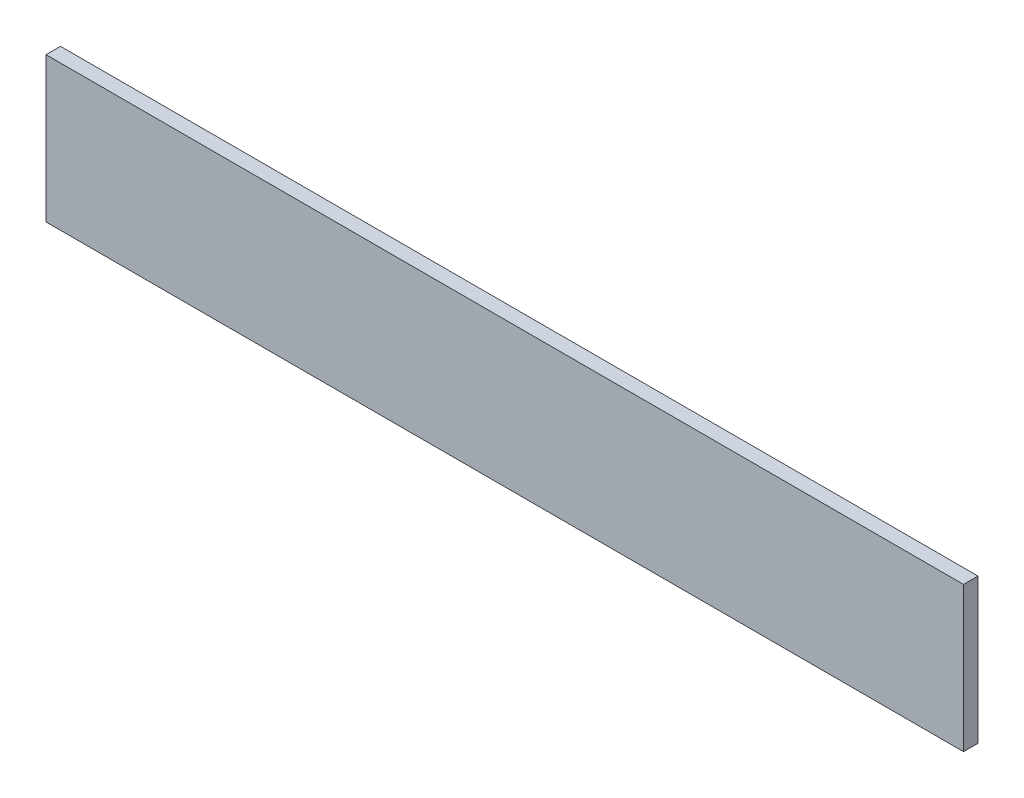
ISO-10303-21;
HEADER;
FILE_DESCRIPTION(('STEP AP214'),'2;1');
FILE_NAME('part.step','',(''),(''),'','','');
FILE_SCHEMA(('AUTOMOTIVE_DESIGN { 1 0 10303 214 1 1 1 1 }'));
ENDSEC;
DATA;
#1=APPLICATION_CONTEXT('core data for automotive mechanical design processes');
#2=APPLICATION_PROTOCOL_DEFINITION('international standard','automotive_design',2000,#1);
#3=PRODUCT_CONTEXT('',#1,'mechanical');
#4=PRODUCT('Part','Part','',(#3));
#5=PRODUCT_RELATED_PRODUCT_CATEGORY('part','',(#4));
#6=PRODUCT_DEFINITION_FORMATION('','',#4);
#7=PRODUCT_DEFINITION_CONTEXT('part definition',#1,'design');
#8=PRODUCT_DEFINITION('design','',#6,#7);
#9=PRODUCT_DEFINITION_SHAPE('','',#8);
#10=(LENGTH_UNIT() NAMED_UNIT(*) SI_UNIT(.MILLI.,.METRE.));
#11=(NAMED_UNIT(*) PLANE_ANGLE_UNIT() SI_UNIT($,.RADIAN.));
#12=(NAMED_UNIT(*) SI_UNIT($,.STERADIAN.) SOLID_ANGLE_UNIT());
#13=UNCERTAINTY_MEASURE_WITH_UNIT(LENGTH_MEASURE(1.E-05),#10,'distance_accuracy_value','');
#14=(GEOMETRIC_REPRESENTATION_CONTEXT(3) GLOBAL_UNCERTAINTY_ASSIGNED_CONTEXT((#13)) GLOBAL_UNIT_ASSIGNED_CONTEXT((#10,
#11,#12)) REPRESENTATION_CONTEXT('',''));
#15=CARTESIAN_POINT('',(0.,0.,0.));
#16=DIRECTION('',(0.,0.,1.));
#17=DIRECTION('',(1.,0.,0.));
#18=AXIS2_PLACEMENT_3D('',#15,#16,#17);
#19=CARTESIAN_POINT('',(0.,0.,6.));
#20=DIRECTION('',(1.,0.,0.));
#21=DIRECTION('',(0.,0.,-1.));
#22=AXIS2_PLACEMENT_3D('',#19,#20,#21);
#23=PLANE('',#22);
#24=DIRECTION('',(0.,-1.,0.));
#25=VECTOR('',#24,1.);
#26=CARTESIAN_POINT('',(0.,0.,0.));
#27=LINE('',#26,#25);
#28=CARTESIAN_POINT('',(0.,60.,0.));
#29=VERTEX_POINT('',#28);
#30=CARTESIAN_POINT('',(0.,0.,0.));
#31=VERTEX_POINT('',#30);
#32=EDGE_CURVE('E102',#29,#31,#27,.T.);
#33=ORIENTED_EDGE('',*,*,#32,.T.);
#34=DIRECTION('',(0.,0.,-1.));
#35=VECTOR('',#34,1.);
#36=CARTESIAN_POINT('',(0.,0.,6.));
#37=LINE('',#36,#35);
#38=CARTESIAN_POINT('',(0.,0.,6.));
#39=VERTEX_POINT('',#38);
#40=EDGE_CURVE('E11',#39,#31,#37,.T.);
#41=ORIENTED_EDGE('',*,*,#40,.F.);
#42=DIRECTION('',(0.,-1.,0.));
#43=VECTOR('',#42,1.);
#44=CARTESIAN_POINT('',(0.,0.,6.));
#45=LINE('',#44,#43);
#46=CARTESIAN_POINT('',(0.,60.,6.));
#47=VERTEX_POINT('',#46);
#48=EDGE_CURVE('E90',#47,#39,#45,.T.);
#49=ORIENTED_EDGE('',*,*,#48,.F.);
#50=DIRECTION('',(0.,0.,-1.));
#51=VECTOR('',#50,1.);
#52=CARTESIAN_POINT('',(0.,60.,6.));
#53=LINE('',#52,#51);
#54=EDGE_CURVE('E98',#47,#29,#53,.T.);
#55=ORIENTED_EDGE('',*,*,#54,.T.);
#56=EDGE_LOOP('',(#33,#41,#49,#55));
#57=FACE_BOUND('',#56,.T.);
#58=ADVANCED_FACE('F39',(#57),#23,.F.);
#59=CARTESIAN_POINT('',(0.,0.,6.));
#60=DIRECTION('',(0.,1.,0.));
#61=DIRECTION('',(0.,0.,1.));
#62=AXIS2_PLACEMENT_3D('',#59,#60,#61);
#63=PLANE('',#62);
#64=DIRECTION('',(1.,0.,0.));
#65=VECTOR('',#64,1.);
#66=CARTESIAN_POINT('',(0.,0.,0.));
#67=LINE('',#66,#65);
#68=CARTESIAN_POINT('',(380.,0.,0.));
#69=VERTEX_POINT('',#68);
#70=EDGE_CURVE('E94',#31,#69,#67,.T.);
#71=ORIENTED_EDGE('',*,*,#70,.T.);
#72=DIRECTION('',(0.,0.,-1.));
#73=VECTOR('',#72,1.);
#74=CARTESIAN_POINT('',(380.,0.,6.));
#75=LINE('',#74,#73);
#76=CARTESIAN_POINT('',(380.,0.,6.));
#77=VERTEX_POINT('',#76);
#78=EDGE_CURVE('E47',#77,#69,#75,.T.);
#79=ORIENTED_EDGE('',*,*,#78,.F.);
#80=DIRECTION('',(1.,0.,0.));
#81=VECTOR('',#80,1.);
#82=CARTESIAN_POINT('',(0.,0.,6.));
#83=LINE('',#82,#81);
#84=EDGE_CURVE('E85',#39,#77,#83,.T.);
#85=ORIENTED_EDGE('',*,*,#84,.F.);
#86=ORIENTED_EDGE('',*,*,#40,.T.);
#87=EDGE_LOOP('',(#71,#79,#85,#86));
#88=FACE_BOUND('',#87,.T.);
#89=ADVANCED_FACE('F93',(#88),#63,.F.);
#90=CARTESIAN_POINT('',(380.,0.,6.));
#91=DIRECTION('',(-1.,0.,0.));
#92=DIRECTION('',(0.,0.,1.));
#93=AXIS2_PLACEMENT_3D('',#90,#91,#92);
#94=PLANE('',#93);
#95=DIRECTION('',(0.,1.,0.));
#96=VECTOR('',#95,1.);
#97=CARTESIAN_POINT('',(380.,0.,0.));
#98=LINE('',#97,#96);
#99=CARTESIAN_POINT('',(380.,60.,0.));
#100=VERTEX_POINT('',#99);
#101=EDGE_CURVE('E72',#69,#100,#98,.T.);
#102=ORIENTED_EDGE('',*,*,#101,.T.);
#103=DIRECTION('',(0.,0.,-1.));
#104=VECTOR('',#103,1.);
#105=CARTESIAN_POINT('',(380.,60.,6.));
#106=LINE('',#105,#104);
#107=CARTESIAN_POINT('',(380.,60.,6.));
#108=VERTEX_POINT('',#107);
#109=EDGE_CURVE('E95',#108,#100,#106,.T.);
#110=ORIENTED_EDGE('',*,*,#109,.F.);
#111=DIRECTION('',(0.,1.,0.));
#112=VECTOR('',#111,1.);
#113=CARTESIAN_POINT('',(380.,0.,6.));
#114=LINE('',#113,#112);
#115=EDGE_CURVE('E88',#77,#108,#114,.T.);
#116=ORIENTED_EDGE('',*,*,#115,.F.);
#117=ORIENTED_EDGE('',*,*,#78,.T.);
#118=EDGE_LOOP('',(#102,#110,#116,#117));
#119=FACE_BOUND('',#118,.T.);
#120=ADVANCED_FACE('F96',(#119),#94,.F.);
#121=CARTESIAN_POINT('',(0.,60.,6.));
#122=DIRECTION('',(0.,-1.,0.));
#123=DIRECTION('',(0.,0.,-1.));
#124=AXIS2_PLACEMENT_3D('',#121,#122,#123);
#125=PLANE('',#124);
#126=DIRECTION('',(-1.,0.,0.));
#127=VECTOR('',#126,1.);
#128=CARTESIAN_POINT('',(0.,60.,0.));
#129=LINE('',#128,#127);
#130=EDGE_CURVE('E78',#100,#29,#129,.T.);
#131=ORIENTED_EDGE('',*,*,#130,.T.);
#132=ORIENTED_EDGE('',*,*,#54,.F.);
#133=DIRECTION('',(-1.,0.,0.));
#134=VECTOR('',#133,1.);
#135=CARTESIAN_POINT('',(0.,60.,6.));
#136=LINE('',#135,#134);
#137=EDGE_CURVE('E55',#108,#47,#136,.T.);
#138=ORIENTED_EDGE('',*,*,#137,.F.);
#139=ORIENTED_EDGE('',*,*,#109,.T.);
#140=EDGE_LOOP('',(#131,#132,#138,#139));
#141=FACE_BOUND('',#140,.T.);
#142=ADVANCED_FACE('F109',(#141),#125,.F.);
#143=CARTESIAN_POINT('',(0.,60.,6.));
#144=DIRECTION('',(0.,0.,-1.));
#145=DIRECTION('',(-1.,0.,0.));
#146=AXIS2_PLACEMENT_3D('',#143,#144,#145);
#147=PLANE('',#146);
#148=ORIENTED_EDGE('',*,*,#48,.T.);
#149=ORIENTED_EDGE('',*,*,#84,.T.);
#150=ORIENTED_EDGE('',*,*,#115,.T.);
#151=ORIENTED_EDGE('',*,*,#137,.T.);
#152=EDGE_LOOP('',(#148,#149,#150,#151));
#153=FACE_BOUND('',#152,.T.);
#154=ADVANCED_FACE('F86',(#153),#147,.F.);
#155=CARTESIAN_POINT('',(0.,60.,0.));
#156=DIRECTION('',(0.,0.,-1.));
#157=DIRECTION('',(-1.,0.,0.));
#158=AXIS2_PLACEMENT_3D('',#155,#156,#157);
#159=PLANE('',#158);
#160=ORIENTED_EDGE('',*,*,#32,.F.);
#161=ORIENTED_EDGE('',*,*,#130,.F.);
#162=ORIENTED_EDGE('',*,*,#101,.F.);
#163=ORIENTED_EDGE('',*,*,#70,.F.);
#164=EDGE_LOOP('',(#160,#161,#162,#163));
#165=FACE_BOUND('',#164,.T.);
#166=ADVANCED_FACE('F112',(#165),#159,.T.);
#167=CLOSED_SHELL('',(#58,#89,#120,#142,#154,#166));
#168=MANIFOLD_SOLID_BREP('B2',#167);
#169=ADVANCED_BREP_SHAPE_REPRESENTATION('',(#18,#168),#14);
#170=SHAPE_DEFINITION_REPRESENTATION(#9,#169);
ENDSEC;
END-ISO-10303-21;
